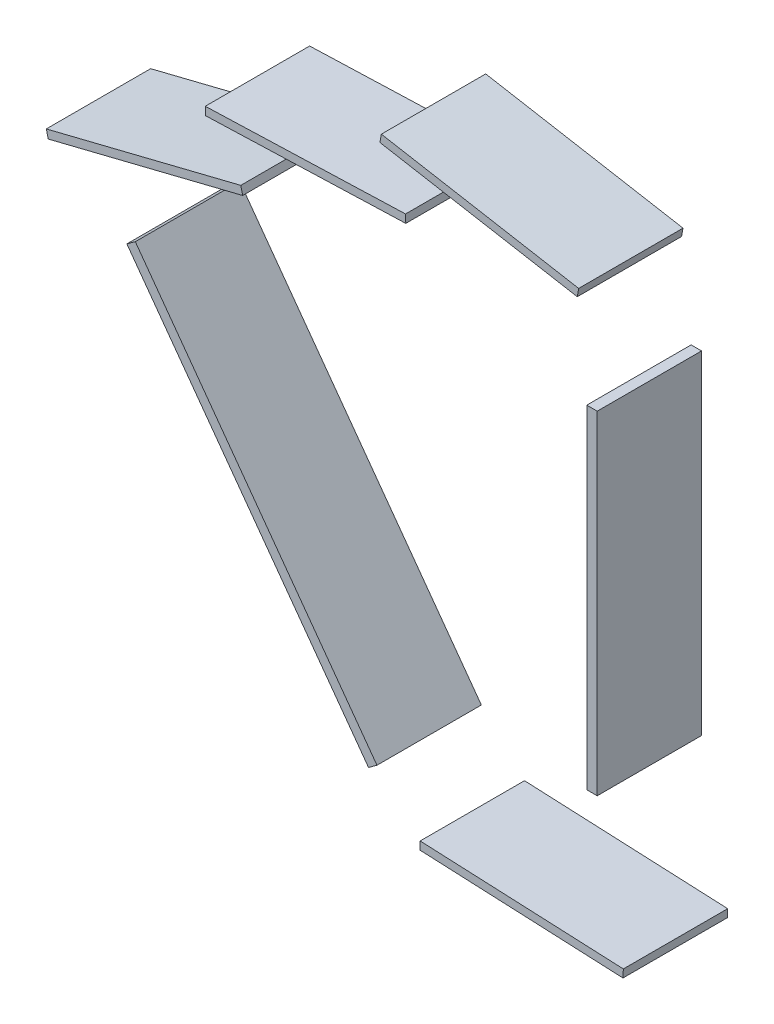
from build123d import *

# Parameters (mm, degrees)
LADDER_REFERENCE_DEPTH   = 10
LADDER_REFERENCE_2_DEPTH = 10
LADDER_REFERENCE_3_DEPTH = 10
LADDER_REFERENCE_4_DEPTH = 10
LADDER_REFERENCE_5_DEPTH = 10
SKETCH4_W                = 1
SKETCH4_H                = 31.918650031
LADDER_REFERENCE_6_DEPTH = 10


with BuildPart() as part:
    # Sketch4 → ladder reference (new body)
    with BuildSketch(Plane.XY):
        Polygon((-34.153795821, 72.343059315), (-33.967611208, 71.594259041), (-52.600277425, 66.961360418), (-52.786462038, 67.710160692), align=None)
    extrude(amount=LADDER_REFERENCE_DEPTH)


with BuildPart() as body_2:
    # Sketch4 → ladder reference 2 (new body)
    with BuildSketch(Plane.XY):
        Polygon((-18.366485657, 77.863163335), (-18.340053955, 77.092016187), (-37.528785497, 76.434306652), (-37.555217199, 77.205453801), align=None)
    extrude(amount=LADDER_REFERENCE_2_DEPTH)


with BuildPart() as body_3:
    # Sketch4 → ladder reference 3 (new body)
    with BuildSketch(Plane.XY):
        Polygon((-1.776471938, 79.980273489), (-1.91094834, 79.220482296), (-20.81710556, 82.566706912), (-20.682629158, 83.326498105), align=None)
    extrude(amount=LADDER_REFERENCE_3_DEPTH)


with BuildPart() as body_4:
    # Sketch4 → ladder reference 4 (new body)
    with BuildSketch(Plane.XY):
        Polygon((-16.710861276, 25.750208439), (2.469306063, 24.877751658), (2.50436792, 25.648554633), (-16.675799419, 26.521011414), (-16.963801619, 26.534111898), (-16.998863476, 25.763308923), align=None)
    extrude(amount=LADDER_REFERENCE_4_DEPTH)


with BuildPart() as body_5:
    # Sketch4 → ladder reference 5 (new body)
    with BuildSketch(Plane.XY):
        Polygon((-45.066178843, 62.028273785), (-44.257161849, 62.616059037), (-21.101625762, 30.745197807), (-21.910642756, 30.157412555), align=None)
    extrude(amount=LADDER_REFERENCE_5_DEPTH)


with BuildPart() as body_6:
    # Sketch4 → ladder reference 6 (new body)
    with BuildSketch(Plane.XY):
        with Locations((-0.5, 54.721732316)):
            Rectangle(SKETCH4_W, SKETCH4_H)
    extrude(amount=LADDER_REFERENCE_6_DEPTH)


solid = Compound([part.part, body_2.part, body_3.part, body_4.part, body_5.part, body_6.part])
